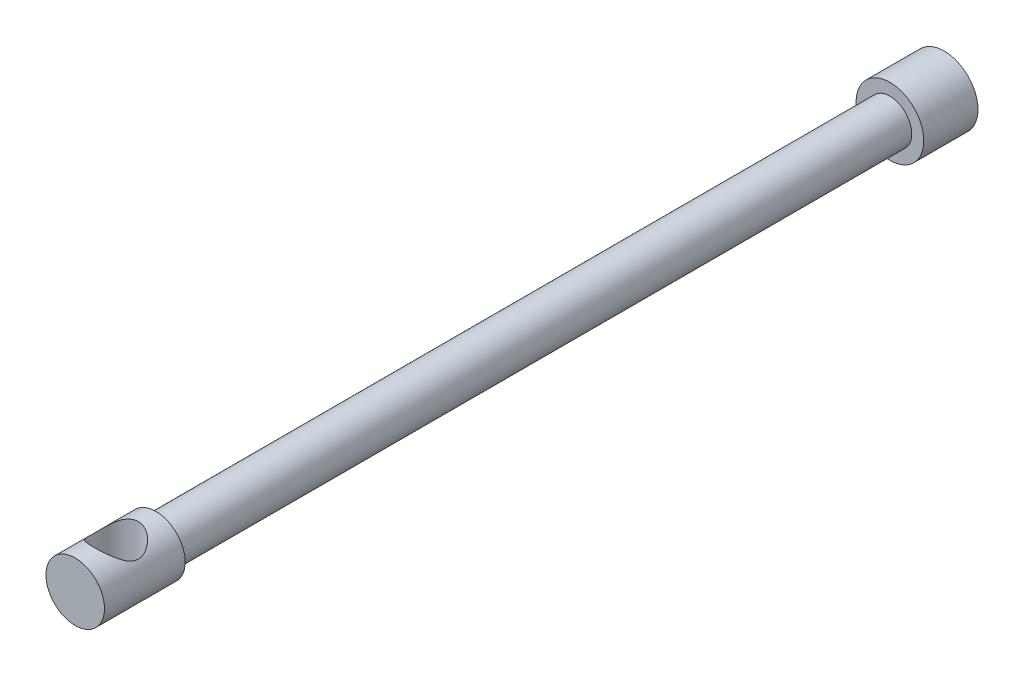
from build123d import *

# Parameters (mm, degrees)
SKETCH1_R               = 3.63855
EXTRUDE1_DEPTH          = 5.842
SKETCH2_R               = 2.3495
EXTRUDE2_DEPTH          = 84.8614
SKETCH3_R               = 3.1496
EXTRUDE3_DEPTH          = 8.6868
CUT_EXTRUDE1_DEPTH      = 94.689614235
CUT_EXTRUDE1_DEPTH_BACK = 94.689614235
SKETCH4_R               = 2.4003


with BuildPart() as part:
    # Sketch1 → Extrude1 (new body)
    with BuildSketch(Plane.XY):
        Circle(SKETCH1_R)
    extrude(amount=EXTRUDE1_DEPTH)

    # Sketch2 → Extrude2 (add)
    with BuildSketch(Plane.XY):
        with Locations(Location((0, 0, 0), (0, 0, 180))):
            Circle(SKETCH2_R)
    extrude(amount=EXTRUDE2_DEPTH)

    # Sketch3 → Extrude3 (add)
    with BuildSketch(Plane.XY.offset(84.8614)):
        Circle(SKETCH3_R)
    extrude(amount=EXTRUDE3_DEPTH)

    # Sketch4 → Cut-Extrude1 (cut, two sides: drawn at the far end of the back side and taken through both)
    with BuildSketch(Plane(origin=(0, 0, 0), x_dir=(1, 0, 0), z_dir=(0, 1, 0)).offset(-CUT_EXTRUDE1_DEPTH_BACK)):
        with Locations(Location((0, -89.154, 0), (0, 0, 270))):
            Circle(SKETCH4_R)
    extrude(amount=CUT_EXTRUDE1_DEPTH + CUT_EXTRUDE1_DEPTH_BACK, mode=Mode.SUBTRACT)


solid = part.part
